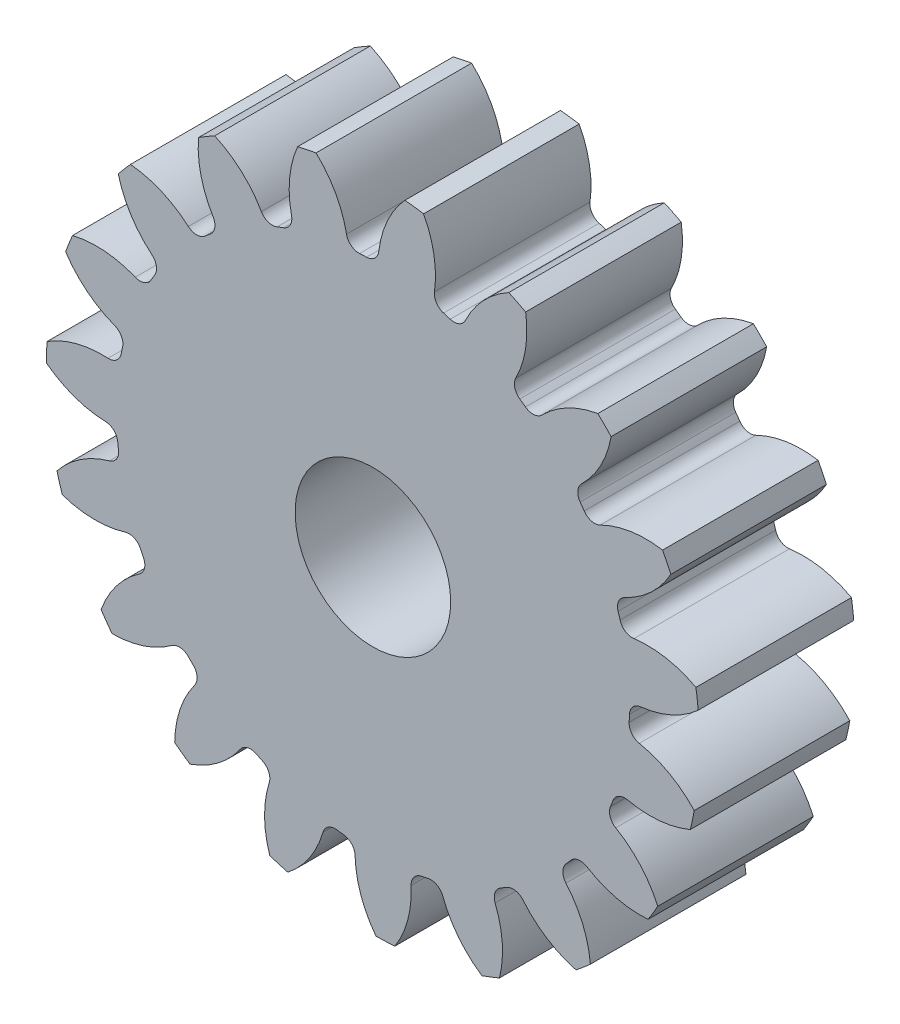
from build123d import *

# Parameters (mm, degrees)
SKETCH3_R         = 213.36
GEARBODY_DEPTH    = 101.6
TOOTHCUT_DEPTH    = 319.382692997
CIRPATTERN1_COUNT = 19
BOREDIA_R         = 50.8
BORE_DEPTH        = 12700


with BuildPart() as part:
    # Sketch3 → gearBody (new body)
    with BuildSketch(Plane.XY):
        Circle(SKETCH3_R)
    extrude(amount=GEARBODY_DEPTH)

    # Sketch2 → toothCut (cut, through all)
    with BuildSketch(Plane.XY):
        with BuildLine():
            ThreePointArc((167.358995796, -9.702377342), (167.475106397, -7.433595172), (167.560461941, -5.163447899))
            ThreePointArc((167.560461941, -5.163447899), (169.752981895, 0.19483098), (174.922002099, 2.802421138))
            ThreePointArc((174.922002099, 2.802421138), (195.571010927, 8.520842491), (213.36, 20.463780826))
            ThreePointArc((213.36, 20.463780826), (214.128286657, -9.504355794), (210.707904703, -39.286573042))
            ThreePointArc((210.707904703, -39.286573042), (194.046991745, -25.814532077), (173.985826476, -18.289137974))
            ThreePointArc((173.985826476, -18.289137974), (169.068160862, -15.233837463), (167.358995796, -9.702377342))
        make_face()
    toothcut = extrude(amount=TOOTHCUT_DEPTH, mode=Mode.SUBTRACT)

    # CirPattern1: toothCut ×19 about axis
    cirpattern1_axis = Axis((0, 0, 0), (0, 0, 1))
    for i in range(1, CIRPATTERN1_COUNT):
        add(toothcut.rotate(cirpattern1_axis, i * 360 / CIRPATTERN1_COUNT), mode=Mode.SUBTRACT)

    # boreDia → bore (cut, symmetric)
    with BuildSketch(Plane.XY):
        Circle(BOREDIA_R)
    extrude(amount=BORE_DEPTH, both=True, mode=Mode.SUBTRACT)


solid = part.part
